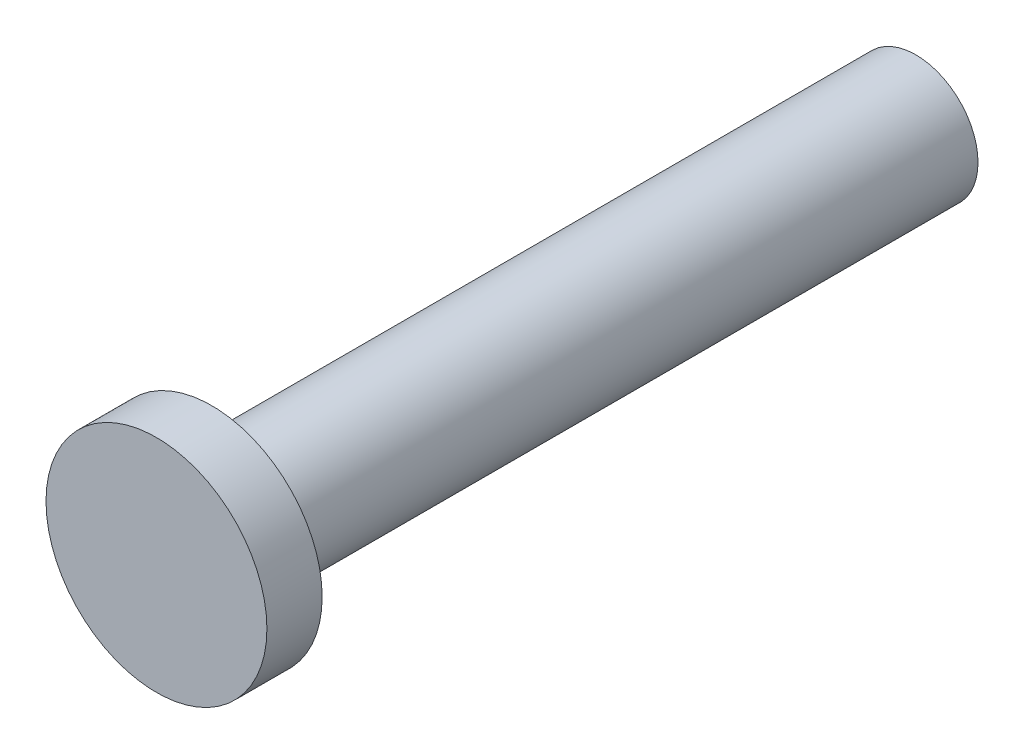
from build123d import *

# Parameters (mm, degrees)
ESBO_O1_R                 = 4.5
RESSALTO_EXTRUS_O1_DEPTH  = 51
ESBO_O2_R                 = 8
RESSALTO_EXTRUS_O2_DEPTH  = 4
FURO_ROSCADO_DE_M51_D     = 4.2
FURO_ROSCADO_DE_M51_DEPTH = 14
FURO_ROSCADO_DE_M51_TIP   = 1.2618073


with BuildPart() as part:
    # Esbo_o1 → Ressalto-extrus_o1 (new body)
    with BuildSketch(Plane.XY):
        Circle(ESBO_O1_R)
    extrude(amount=RESSALTO_EXTRUS_O1_DEPTH)

    # Esbo_o2 → Ressalto-extrus_o2 (add)
    with BuildSketch(Plane.XY.offset(51)):
        Circle(ESBO_O2_R)
    extrude(amount=RESSALTO_EXTRUS_O2_DEPTH)

    # Furo roscado de M51
    with Locations(Plane(origin=(0, 0, 0), x_dir=(-1, 0, 0), z_dir=(0, 0, -1))):
        with Locations((0, 0)):
            Hole(FURO_ROSCADO_DE_M51_D / 2, depth=FURO_ROSCADO_DE_M51_DEPTH)
            with Locations((0, 0, -(FURO_ROSCADO_DE_M51_DEPTH + FURO_ROSCADO_DE_M51_TIP / 2))):  # 118° drill point
                Cone(0, FURO_ROSCADO_DE_M51_D / 2, FURO_ROSCADO_DE_M51_TIP, mode=Mode.SUBTRACT)


solid = part.part
